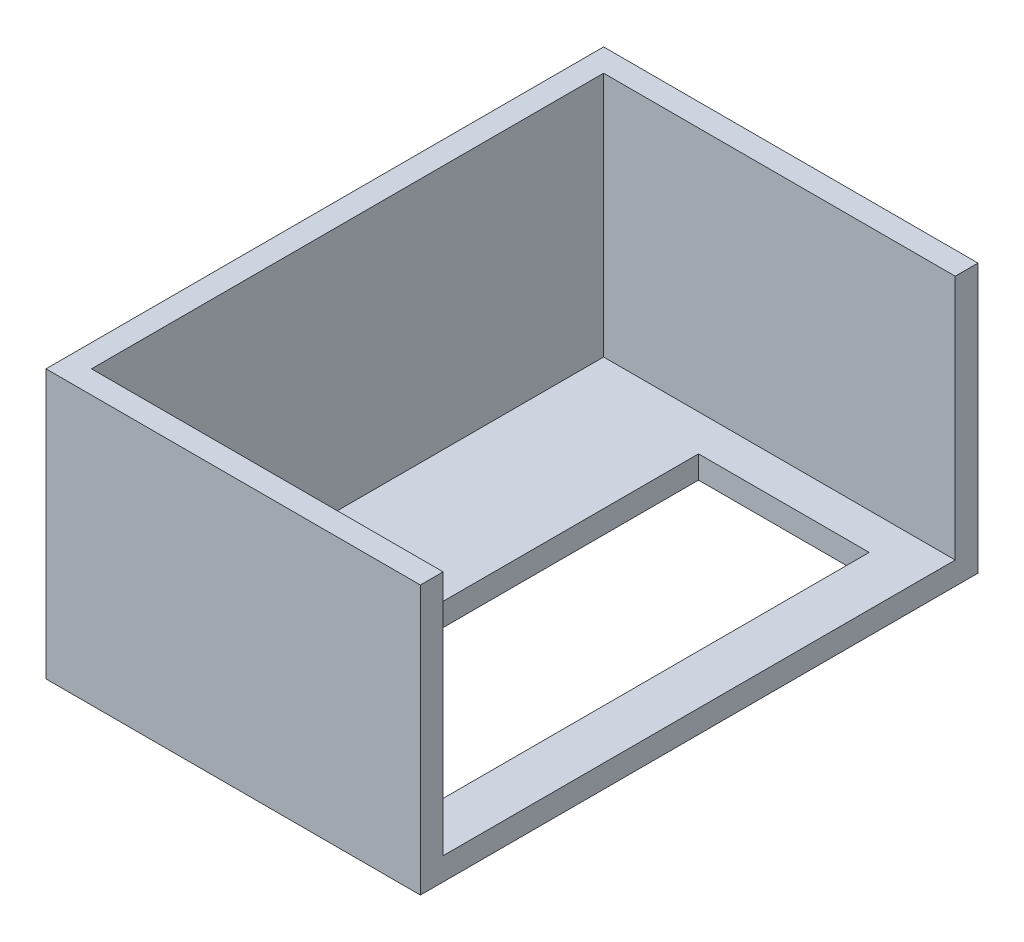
ISO-10303-21;
HEADER;
FILE_DESCRIPTION(('STEP AP214'),'2;1');
FILE_NAME('part.step','',(''),(''),'','','');
FILE_SCHEMA(('AUTOMOTIVE_DESIGN { 1 0 10303 214 1 1 1 1 }'));
ENDSEC;
DATA;
#1=APPLICATION_CONTEXT('core data for automotive mechanical design processes');
#2=APPLICATION_PROTOCOL_DEFINITION('international standard','automotive_design',2000,#1);
#3=PRODUCT_CONTEXT('',#1,'mechanical');
#4=PRODUCT('Part','Part','',(#3));
#5=PRODUCT_RELATED_PRODUCT_CATEGORY('part','',(#4));
#6=PRODUCT_DEFINITION_FORMATION('','',#4);
#7=PRODUCT_DEFINITION_CONTEXT('part definition',#1,'design');
#8=PRODUCT_DEFINITION('design','',#6,#7);
#9=PRODUCT_DEFINITION_SHAPE('','',#8);
#10=(LENGTH_UNIT() NAMED_UNIT(*) SI_UNIT(.MILLI.,.METRE.));
#11=(NAMED_UNIT(*) PLANE_ANGLE_UNIT() SI_UNIT($,.RADIAN.));
#12=(NAMED_UNIT(*) SI_UNIT($,.STERADIAN.) SOLID_ANGLE_UNIT());
#13=UNCERTAINTY_MEASURE_WITH_UNIT(LENGTH_MEASURE(1.E-05),#10,'distance_accuracy_value','');
#14=(GEOMETRIC_REPRESENTATION_CONTEXT(3) GLOBAL_UNCERTAINTY_ASSIGNED_CONTEXT((#13)) GLOBAL_UNIT_ASSIGNED_CONTEXT((#10,
#11,#12)) REPRESENTATION_CONTEXT('',''));
#15=CARTESIAN_POINT('',(0.,0.,0.));
#16=DIRECTION('',(0.,0.,1.));
#17=DIRECTION('',(1.,0.,0.));
#18=AXIS2_PLACEMENT_3D('',#15,#16,#17);
#19=CARTESIAN_POINT('',(0.,1.,0.));
#20=DIRECTION('',(0.,1.,0.));
#21=DIRECTION('',(0.,0.,1.));
#22=AXIS2_PLACEMENT_3D('',#19,#20,#21);
#23=PLANE('',#22);
#24=DIRECTION('',(0.,0.,1.));
#25=VECTOR('',#24,1.);
#26=CARTESIAN_POINT('',(-4681.56519736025,1.,-3405.1084925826));
#27=LINE('',#26,#25);
#28=CARTESIAN_POINT('',(-4681.56519736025,1.,-3405.1084925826));
#29=VERTEX_POINT('',#28);
#30=CARTESIAN_POINT('',(-4681.56519736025,1.,-3385.8084925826));
#31=VERTEX_POINT('',#30);
#32=EDGE_CURVE('E51',#29,#31,#27,.T.);
#33=ORIENTED_EDGE('',*,*,#32,.F.);
#34=DIRECTION('',(-1.,0.,0.));
#35=VECTOR('',#34,1.);
#36=CARTESIAN_POINT('',(-4681.56519736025,1.,-3405.1084925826));
#37=LINE('',#36,#35);
#38=CARTESIAN_POINT('',(-4674.06519736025,1.,-3405.1084925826));
#39=VERTEX_POINT('',#38);
#40=EDGE_CURVE('E214',#39,#29,#37,.T.);
#41=ORIENTED_EDGE('',*,*,#40,.F.);
#42=DIRECTION('',(0.,0.,-1.));
#43=VECTOR('',#42,1.);
#44=CARTESIAN_POINT('',(-4674.06519736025,1.,-3405.1084925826));
#45=LINE('',#44,#43);
#46=CARTESIAN_POINT('',(-4674.06519736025,1.,-3385.8084925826));
#47=VERTEX_POINT('',#46);
#48=EDGE_CURVE('E218',#47,#39,#45,.T.);
#49=ORIENTED_EDGE('',*,*,#48,.F.);
#50=DIRECTION('',(1.,0.,0.));
#51=VECTOR('',#50,1.);
#52=CARTESIAN_POINT('',(-4681.56519736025,1.,-3385.8084925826));
#53=LINE('',#52,#51);
#54=EDGE_CURVE('E221',#31,#47,#53,.T.);
#55=ORIENTED_EDGE('',*,*,#54,.F.);
#56=EDGE_LOOP('',(#33,#41,#49,#55));
#57=FACE_BOUND('',#56,.T.);
#58=DIRECTION('',(1.,0.,0.));
#59=VECTOR('',#58,1.);
#60=CARTESIAN_POINT('',(-4688.33519736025,1.,-3406.7084925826));
#61=LINE('',#60,#59);
#62=CARTESIAN_POINT('',(-4687.33519736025,1.,-3406.7084925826));
#63=VERTEX_POINT('',#62);
#64=CARTESIAN_POINT('',(-4671.88519736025,1.,-3406.7084925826));
#65=VERTEX_POINT('',#64);
#66=EDGE_CURVE('E37',#63,#65,#61,.T.);
#67=ORIENTED_EDGE('',*,*,#66,.F.);
#68=DIRECTION('',(0.,0.,-1.));
#69=VECTOR('',#68,1.);
#70=CARTESIAN_POINT('',(-4687.33519736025,1.,-3384.2084925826));
#71=LINE('',#70,#69);
#72=CARTESIAN_POINT('',(-4687.33519736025,1.,-3384.2084925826));
#73=VERTEX_POINT('',#72);
#74=EDGE_CURVE('E134',#73,#63,#71,.T.);
#75=ORIENTED_EDGE('',*,*,#74,.F.);
#76=DIRECTION('',(-1.,0.,0.));
#77=VECTOR('',#76,1.);
#78=CARTESIAN_POINT('',(-4688.33519736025,1.,-3384.2084925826));
#79=LINE('',#78,#77);
#80=CARTESIAN_POINT('',(-4671.88519736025,1.,-3384.2084925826));
#81=VERTEX_POINT('',#80);
#82=EDGE_CURVE('E142',#81,#73,#79,.T.);
#83=ORIENTED_EDGE('',*,*,#82,.F.);
#84=DIRECTION('',(0.,0.,-1.));
#85=VECTOR('',#84,1.);
#86=CARTESIAN_POINT('',(-4671.88519736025,1.,-3407.7084925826));
#87=LINE('',#86,#85);
#88=EDGE_CURVE('E174',#81,#65,#87,.T.);
#89=ORIENTED_EDGE('',*,*,#88,.T.);
#90=EDGE_LOOP('',(#67,#75,#83,#89));
#91=FACE_BOUND('',#90,.T.);
#92=ADVANCED_FACE('F33',(#57,#91),#23,.T.);
#93=CARTESIAN_POINT('',(-4688.33519736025,11.8,-3406.7084925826));
#94=DIRECTION('',(0.,0.,-1.));
#95=DIRECTION('',(-1.,0.,0.));
#96=AXIS2_PLACEMENT_3D('',#93,#94,#95);
#97=PLANE('',#96);
#98=DIRECTION('',(0.,-1.,0.));
#99=VECTOR('',#98,1.);
#100=CARTESIAN_POINT('',(-4687.33519736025,11.8,-3406.7084925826));
#101=LINE('',#100,#99);
#102=CARTESIAN_POINT('',(-4687.33519736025,11.8,-3406.7084925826));
#103=VERTEX_POINT('',#102);
#104=EDGE_CURVE('E130',#103,#63,#101,.T.);
#105=ORIENTED_EDGE('',*,*,#104,.T.);
#106=ORIENTED_EDGE('',*,*,#66,.T.);
#107=DIRECTION('',(0.,-1.,0.));
#108=VECTOR('',#107,1.);
#109=CARTESIAN_POINT('',(-4671.88519736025,11.8,-3406.7084925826));
#110=LINE('',#109,#108);
#111=CARTESIAN_POINT('',(-4671.88519736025,11.8,-3406.7084925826));
#112=VERTEX_POINT('',#111);
#113=EDGE_CURVE('E167',#112,#65,#110,.T.);
#114=ORIENTED_EDGE('',*,*,#113,.F.);
#115=DIRECTION('',(1.,0.,0.));
#116=VECTOR('',#115,1.);
#117=CARTESIAN_POINT('',(-4688.33519736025,11.8,-3406.7084925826));
#118=LINE('',#117,#116);
#119=EDGE_CURVE('E160',#103,#112,#118,.T.);
#120=ORIENTED_EDGE('',*,*,#119,.F.);
#121=EDGE_LOOP('',(#105,#106,#114,#120));
#122=FACE_BOUND('',#121,.T.);
#123=ADVANCED_FACE('F237',(#122),#97,.F.);
#124=CARTESIAN_POINT('',(-4688.33519736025,11.8,-3384.2084925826));
#125=DIRECTION('',(0.,0.,1.));
#126=DIRECTION('',(1.,0.,0.));
#127=AXIS2_PLACEMENT_3D('',#124,#125,#126);
#128=PLANE('',#127);
#129=DIRECTION('',(0.,-1.,0.));
#130=VECTOR('',#129,1.);
#131=CARTESIAN_POINT('',(-4687.33519736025,11.8,-3384.2084925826));
#132=LINE('',#131,#130);
#133=CARTESIAN_POINT('',(-4687.33519736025,11.8,-3384.2084925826));
#134=VERTEX_POINT('',#133);
#135=EDGE_CURVE('E127',#134,#73,#132,.T.);
#136=ORIENTED_EDGE('',*,*,#135,.F.);
#137=DIRECTION('',(-1.,0.,0.));
#138=VECTOR('',#137,1.);
#139=CARTESIAN_POINT('',(-4688.33519736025,11.8,-3384.2084925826));
#140=LINE('',#139,#138);
#141=CARTESIAN_POINT('',(-4671.88519736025,11.8,-3384.2084925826));
#142=VERTEX_POINT('',#141);
#143=EDGE_CURVE('E140',#142,#134,#140,.T.);
#144=ORIENTED_EDGE('',*,*,#143,.F.);
#145=DIRECTION('',(0.,-1.,0.));
#146=VECTOR('',#145,1.);
#147=CARTESIAN_POINT('',(-4671.88519736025,11.8,-3384.2084925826));
#148=LINE('',#147,#146);
#149=EDGE_CURVE('E149',#142,#81,#148,.T.);
#150=ORIENTED_EDGE('',*,*,#149,.T.);
#151=ORIENTED_EDGE('',*,*,#82,.T.);
#152=EDGE_LOOP('',(#136,#144,#150,#151));
#153=FACE_BOUND('',#152,.T.);
#154=ADVANCED_FACE('F139',(#153),#128,.F.);
#155=CARTESIAN_POINT('',(-4688.33519736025,1.,-3407.7084925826));
#156=DIRECTION('',(1.,0.,0.));
#157=DIRECTION('',(0.,0.,-1.));
#158=AXIS2_PLACEMENT_3D('',#155,#156,#157);
#159=PLANE('',#158);
#160=DIRECTION('',(0.,0.,1.));
#161=VECTOR('',#160,1.);
#162=CARTESIAN_POINT('',(-4688.33519736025,0.,-3407.7084925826));
#163=LINE('',#162,#161);
#164=CARTESIAN_POINT('',(-4688.33519736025,0.,-3407.7084925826));
#165=VERTEX_POINT('',#164);
#166=CARTESIAN_POINT('',(-4688.33519736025,0.,-3383.2084925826));
#167=VERTEX_POINT('',#166);
#168=EDGE_CURVE('E172',#165,#167,#163,.T.);
#169=ORIENTED_EDGE('',*,*,#168,.T.);
#170=DIRECTION('',(0.,-1.,0.));
#171=VECTOR('',#170,1.);
#172=CARTESIAN_POINT('',(-4688.33519736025,1.,-3383.2084925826));
#173=LINE('',#172,#171);
#174=CARTESIAN_POINT('',(-4688.33519736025,11.8,-3383.2084925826));
#175=VERTEX_POINT('',#174);
#176=EDGE_CURVE('E11',#175,#167,#173,.T.);
#177=ORIENTED_EDGE('',*,*,#176,.F.);
#178=DIRECTION('',(0.,0.,1.));
#179=VECTOR('',#178,1.);
#180=CARTESIAN_POINT('',(-4688.33519736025,11.8,-3407.7084925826));
#181=LINE('',#180,#179);
#182=CARTESIAN_POINT('',(-4688.33519736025,11.8,-3407.7084925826));
#183=VERTEX_POINT('',#182);
#184=EDGE_CURVE('E158',#183,#175,#181,.T.);
#185=ORIENTED_EDGE('',*,*,#184,.F.);
#186=DIRECTION('',(0.,-1.,0.));
#187=VECTOR('',#186,1.);
#188=CARTESIAN_POINT('',(-4688.33519736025,1.,-3407.7084925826));
#189=LINE('',#188,#187);
#190=EDGE_CURVE('E177',#183,#165,#189,.T.);
#191=ORIENTED_EDGE('',*,*,#190,.T.);
#192=EDGE_LOOP('',(#169,#177,#185,#191));
#193=FACE_BOUND('',#192,.T.);
#194=ADVANCED_FACE('F35',(#193),#159,.F.);
#195=CARTESIAN_POINT('',(-4688.33519736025,1.,-3383.2084925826));
#196=DIRECTION('',(0.,0.,-1.));
#197=DIRECTION('',(-1.,0.,0.));
#198=AXIS2_PLACEMENT_3D('',#195,#196,#197);
#199=PLANE('',#198);
#200=DIRECTION('',(1.,0.,0.));
#201=VECTOR('',#200,1.);
#202=CARTESIAN_POINT('',(-4688.33519736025,0.,-3383.2084925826));
#203=LINE('',#202,#201);
#204=CARTESIAN_POINT('',(-4671.88519736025,0.,-3383.2084925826));
#205=VERTEX_POINT('',#204);
#206=EDGE_CURVE('E192',#167,#205,#203,.T.);
#207=ORIENTED_EDGE('',*,*,#206,.T.);
#208=DIRECTION('',(0.,-1.,0.));
#209=VECTOR('',#208,1.);
#210=CARTESIAN_POINT('',(-4671.88519736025,1.,-3383.2084925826));
#211=LINE('',#210,#209);
#212=CARTESIAN_POINT('',(-4671.88519736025,11.8,-3383.2084925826));
#213=VERTEX_POINT('',#212);
#214=EDGE_CURVE('E43',#213,#205,#211,.T.);
#215=ORIENTED_EDGE('',*,*,#214,.F.);
#216=DIRECTION('',(1.,0.,0.));
#217=VECTOR('',#216,1.);
#218=CARTESIAN_POINT('',(-4688.33519736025,11.8,-3383.2084925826));
#219=LINE('',#218,#217);
#220=EDGE_CURVE('E152',#175,#213,#219,.T.);
#221=ORIENTED_EDGE('',*,*,#220,.F.);
#222=ORIENTED_EDGE('',*,*,#176,.T.);
#223=EDGE_LOOP('',(#207,#215,#221,#222));
#224=FACE_BOUND('',#223,.T.);
#225=ADVANCED_FACE('F204',(#224),#199,.F.);
#226=CARTESIAN_POINT('',(-4671.88519736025,1.,-3407.7084925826));
#227=DIRECTION('',(-1.,0.,0.));
#228=DIRECTION('',(0.,0.,1.));
#229=AXIS2_PLACEMENT_3D('',#226,#227,#228);
#230=PLANE('',#229);
#231=DIRECTION('',(0.,0.,-1.));
#232=VECTOR('',#231,1.);
#233=CARTESIAN_POINT('',(-4671.88519736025,0.,-3407.7084925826));
#234=LINE('',#233,#232);
#235=CARTESIAN_POINT('',(-4671.88519736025,0.,-3407.7084925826));
#236=VERTEX_POINT('',#235);
#237=EDGE_CURVE('E191',#205,#236,#234,.T.);
#238=ORIENTED_EDGE('',*,*,#237,.T.);
#239=DIRECTION('',(0.,-1.,0.));
#240=VECTOR('',#239,1.);
#241=CARTESIAN_POINT('',(-4671.88519736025,1.,-3407.7084925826));
#242=LINE('',#241,#240);
#243=CARTESIAN_POINT('',(-4671.88519736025,11.8,-3407.7084925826));
#244=VERTEX_POINT('',#243);
#245=EDGE_CURVE('E185',#244,#236,#242,.T.);
#246=ORIENTED_EDGE('',*,*,#245,.F.);
#247=DIRECTION('',(0.,0.,-1.));
#248=VECTOR('',#247,1.);
#249=CARTESIAN_POINT('',(-4671.88519736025,11.8,-3407.7084925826));
#250=LINE('',#249,#248);
#251=EDGE_CURVE('E162',#112,#244,#250,.T.);
#252=ORIENTED_EDGE('',*,*,#251,.F.);
#253=ORIENTED_EDGE('',*,*,#113,.T.);
#254=ORIENTED_EDGE('',*,*,#88,.F.);
#255=ORIENTED_EDGE('',*,*,#149,.F.);
#256=DIRECTION('',(0.,0.,-1.));
#257=VECTOR('',#256,1.);
#258=CARTESIAN_POINT('',(-4671.88519736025,11.8,-3383.2084925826));
#259=LINE('',#258,#257);
#260=EDGE_CURVE('E147',#213,#142,#259,.T.);
#261=ORIENTED_EDGE('',*,*,#260,.F.);
#262=ORIENTED_EDGE('',*,*,#214,.T.);
#263=EDGE_LOOP('',(#238,#246,#252,#253,#254,#255,#261,#262));
#264=FACE_BOUND('',#263,.T.);
#265=ADVANCED_FACE('F242',(#264),#230,.F.);
#266=CARTESIAN_POINT('',(-4688.33519736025,1.,-3407.7084925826));
#267=DIRECTION('',(0.,0.,1.));
#268=DIRECTION('',(1.,0.,0.));
#269=AXIS2_PLACEMENT_3D('',#266,#267,#268);
#270=PLANE('',#269);
#271=DIRECTION('',(-1.,0.,0.));
#272=VECTOR('',#271,1.);
#273=CARTESIAN_POINT('',(-4688.33519736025,0.,-3407.7084925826));
#274=LINE('',#273,#272);
#275=EDGE_CURVE('E178',#236,#165,#274,.T.);
#276=ORIENTED_EDGE('',*,*,#275,.T.);
#277=ORIENTED_EDGE('',*,*,#190,.F.);
#278=DIRECTION('',(-1.,0.,0.));
#279=VECTOR('',#278,1.);
#280=CARTESIAN_POINT('',(-4688.33519736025,11.8,-3407.7084925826));
#281=LINE('',#280,#279);
#282=EDGE_CURVE('E165',#244,#183,#281,.T.);
#283=ORIENTED_EDGE('',*,*,#282,.F.);
#284=ORIENTED_EDGE('',*,*,#245,.T.);
#285=EDGE_LOOP('',(#276,#277,#283,#284));
#286=FACE_BOUND('',#285,.T.);
#287=ADVANCED_FACE('F245',(#286),#270,.F.);
#288=CARTESIAN_POINT('',(0.,0.,0.));
#289=DIRECTION('',(0.,1.,0.));
#290=DIRECTION('',(0.,0.,1.));
#291=AXIS2_PLACEMENT_3D('',#288,#289,#290);
#292=PLANE('',#291);
#293=DIRECTION('',(-1.,0.,0.));
#294=VECTOR('',#293,1.);
#295=CARTESIAN_POINT('',(-4681.56519736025,0.,-3405.1084925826));
#296=LINE('',#295,#294);
#297=CARTESIAN_POINT('',(-4674.06519736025,0.,-3405.1084925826));
#298=VERTEX_POINT('',#297);
#299=CARTESIAN_POINT('',(-4681.56519736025,0.,-3405.1084925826));
#300=VERTEX_POINT('',#299);
#301=EDGE_CURVE('E209',#298,#300,#296,.T.);
#302=ORIENTED_EDGE('',*,*,#301,.T.);
#303=DIRECTION('',(0.,0.,1.));
#304=VECTOR('',#303,1.);
#305=CARTESIAN_POINT('',(-4681.56519736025,0.,-3405.1084925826));
#306=LINE('',#305,#304);
#307=CARTESIAN_POINT('',(-4681.56519736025,0.,-3385.8084925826));
#308=VERTEX_POINT('',#307);
#309=EDGE_CURVE('E217',#300,#308,#306,.T.);
#310=ORIENTED_EDGE('',*,*,#309,.T.);
#311=DIRECTION('',(1.,0.,0.));
#312=VECTOR('',#311,1.);
#313=CARTESIAN_POINT('',(-4681.56519736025,0.,-3385.8084925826));
#314=LINE('',#313,#312);
#315=CARTESIAN_POINT('',(-4674.06519736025,0.,-3385.8084925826));
#316=VERTEX_POINT('',#315);
#317=EDGE_CURVE('E228',#308,#316,#314,.T.);
#318=ORIENTED_EDGE('',*,*,#317,.T.);
#319=DIRECTION('',(0.,0.,-1.));
#320=VECTOR('',#319,1.);
#321=CARTESIAN_POINT('',(-4674.06519736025,0.,-3405.1084925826));
#322=LINE('',#321,#320);
#323=EDGE_CURVE('E59',#316,#298,#322,.T.);
#324=ORIENTED_EDGE('',*,*,#323,.T.);
#325=EDGE_LOOP('',(#302,#310,#318,#324));
#326=FACE_BOUND('',#325,.T.);
#327=ORIENTED_EDGE('',*,*,#168,.F.);
#328=ORIENTED_EDGE('',*,*,#275,.F.);
#329=ORIENTED_EDGE('',*,*,#237,.F.);
#330=ORIENTED_EDGE('',*,*,#206,.F.);
#331=EDGE_LOOP('',(#327,#328,#329,#330));
#332=FACE_BOUND('',#331,.T.);
#333=ADVANCED_FACE('F202',(#326,#332),#292,.F.);
#334=CARTESIAN_POINT('',(0.,11.8,0.));
#335=DIRECTION('',(0.,1.,0.));
#336=DIRECTION('',(0.,0.,1.));
#337=AXIS2_PLACEMENT_3D('',#334,#335,#336);
#338=PLANE('',#337);
#339=ORIENTED_EDGE('',*,*,#184,.T.);
#340=ORIENTED_EDGE('',*,*,#220,.T.);
#341=ORIENTED_EDGE('',*,*,#260,.T.);
#342=ORIENTED_EDGE('',*,*,#143,.T.);
#343=DIRECTION('',(0.,0.,-1.));
#344=VECTOR('',#343,1.);
#345=CARTESIAN_POINT('',(-4687.33519736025,11.8,-3384.2084925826));
#346=LINE('',#345,#344);
#347=EDGE_CURVE('E124',#134,#103,#346,.T.);
#348=ORIENTED_EDGE('',*,*,#347,.T.);
#349=ORIENTED_EDGE('',*,*,#119,.T.);
#350=ORIENTED_EDGE('',*,*,#251,.T.);
#351=ORIENTED_EDGE('',*,*,#282,.T.);
#352=EDGE_LOOP('',(#339,#340,#341,#342,#348,#349,#350,#351));
#353=FACE_BOUND('',#352,.T.);
#354=ADVANCED_FACE('F144',(#353),#338,.T.);
#355=CARTESIAN_POINT('',(-4681.56519736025,0.,-3405.1084925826));
#356=DIRECTION('',(-1.,0.,0.));
#357=DIRECTION('',(0.,0.,1.));
#358=AXIS2_PLACEMENT_3D('',#355,#356,#357);
#359=PLANE('',#358);
#360=ORIENTED_EDGE('',*,*,#32,.T.);
#361=DIRECTION('',(0.,1.,0.));
#362=VECTOR('',#361,1.);
#363=CARTESIAN_POINT('',(-4681.56519736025,0.,-3385.8084925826));
#364=LINE('',#363,#362);
#365=EDGE_CURVE('E206',#308,#31,#364,.T.);
#366=ORIENTED_EDGE('',*,*,#365,.F.);
#367=ORIENTED_EDGE('',*,*,#309,.F.);
#368=DIRECTION('',(0.,1.,0.));
#369=VECTOR('',#368,1.);
#370=CARTESIAN_POINT('',(-4681.56519736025,0.,-3405.1084925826));
#371=LINE('',#370,#369);
#372=EDGE_CURVE('E156',#300,#29,#371,.T.);
#373=ORIENTED_EDGE('',*,*,#372,.T.);
#374=EDGE_LOOP('',(#360,#366,#367,#373));
#375=FACE_BOUND('',#374,.T.);
#376=ADVANCED_FACE('F265',(#375),#359,.F.);
#377=CARTESIAN_POINT('',(-4681.56519736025,0.,-3405.1084925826));
#378=DIRECTION('',(0.,0.,-1.));
#379=DIRECTION('',(-1.,0.,0.));
#380=AXIS2_PLACEMENT_3D('',#377,#378,#379);
#381=PLANE('',#380);
#382=ORIENTED_EDGE('',*,*,#40,.T.);
#383=ORIENTED_EDGE('',*,*,#372,.F.);
#384=ORIENTED_EDGE('',*,*,#301,.F.);
#385=DIRECTION('',(0.,1.,0.));
#386=VECTOR('',#385,1.);
#387=CARTESIAN_POINT('',(-4674.06519736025,0.,-3405.1084925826));
#388=LINE('',#387,#386);
#389=EDGE_CURVE('E211',#298,#39,#388,.T.);
#390=ORIENTED_EDGE('',*,*,#389,.T.);
#391=EDGE_LOOP('',(#382,#383,#384,#390));
#392=FACE_BOUND('',#391,.T.);
#393=ADVANCED_FACE('F270',(#392),#381,.F.);
#394=CARTESIAN_POINT('',(-4674.06519736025,0.,-3405.1084925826));
#395=DIRECTION('',(1.,0.,0.));
#396=DIRECTION('',(0.,0.,-1.));
#397=AXIS2_PLACEMENT_3D('',#394,#395,#396);
#398=PLANE('',#397);
#399=ORIENTED_EDGE('',*,*,#48,.T.);
#400=ORIENTED_EDGE('',*,*,#389,.F.);
#401=ORIENTED_EDGE('',*,*,#323,.F.);
#402=DIRECTION('',(0.,1.,0.));
#403=VECTOR('',#402,1.);
#404=CARTESIAN_POINT('',(-4674.06519736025,0.,-3385.8084925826));
#405=LINE('',#404,#403);
#406=EDGE_CURVE('E208',#316,#47,#405,.T.);
#407=ORIENTED_EDGE('',*,*,#406,.T.);
#408=EDGE_LOOP('',(#399,#400,#401,#407));
#409=FACE_BOUND('',#408,.T.);
#410=ADVANCED_FACE('F274',(#409),#398,.F.);
#411=CARTESIAN_POINT('',(-4681.56519736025,0.,-3385.8084925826));
#412=DIRECTION('',(0.,0.,1.));
#413=DIRECTION('',(1.,0.,0.));
#414=AXIS2_PLACEMENT_3D('',#411,#412,#413);
#415=PLANE('',#414);
#416=ORIENTED_EDGE('',*,*,#54,.T.);
#417=ORIENTED_EDGE('',*,*,#406,.F.);
#418=ORIENTED_EDGE('',*,*,#317,.F.);
#419=ORIENTED_EDGE('',*,*,#365,.T.);
#420=EDGE_LOOP('',(#416,#417,#418,#419));
#421=FACE_BOUND('',#420,.T.);
#422=ADVANCED_FACE('F271',(#421),#415,.F.);
#423=CARTESIAN_POINT('',(-4687.33519736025,11.8,-3384.2084925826));
#424=DIRECTION('',(-1.,0.,0.));
#425=DIRECTION('',(0.,0.,1.));
#426=AXIS2_PLACEMENT_3D('',#423,#424,#425);
#427=PLANE('',#426);
#428=ORIENTED_EDGE('',*,*,#74,.T.);
#429=ORIENTED_EDGE('',*,*,#104,.F.);
#430=ORIENTED_EDGE('',*,*,#347,.F.);
#431=ORIENTED_EDGE('',*,*,#135,.T.);
#432=EDGE_LOOP('',(#428,#429,#430,#431));
#433=FACE_BOUND('',#432,.T.);
#434=ADVANCED_FACE('F126',(#433),#427,.F.);
#435=CLOSED_SHELL('',(#92,#123,#154,#194,#225,#265,#287,#333,#354,#376,#393,#410,#422,#434));
#436=MANIFOLD_SOLID_BREP('B2',#435);
#437=ADVANCED_BREP_SHAPE_REPRESENTATION('',(#18,#436),#14);
#438=SHAPE_DEFINITION_REPRESENTATION(#9,#437);
ENDSEC;
END-ISO-10303-21;
